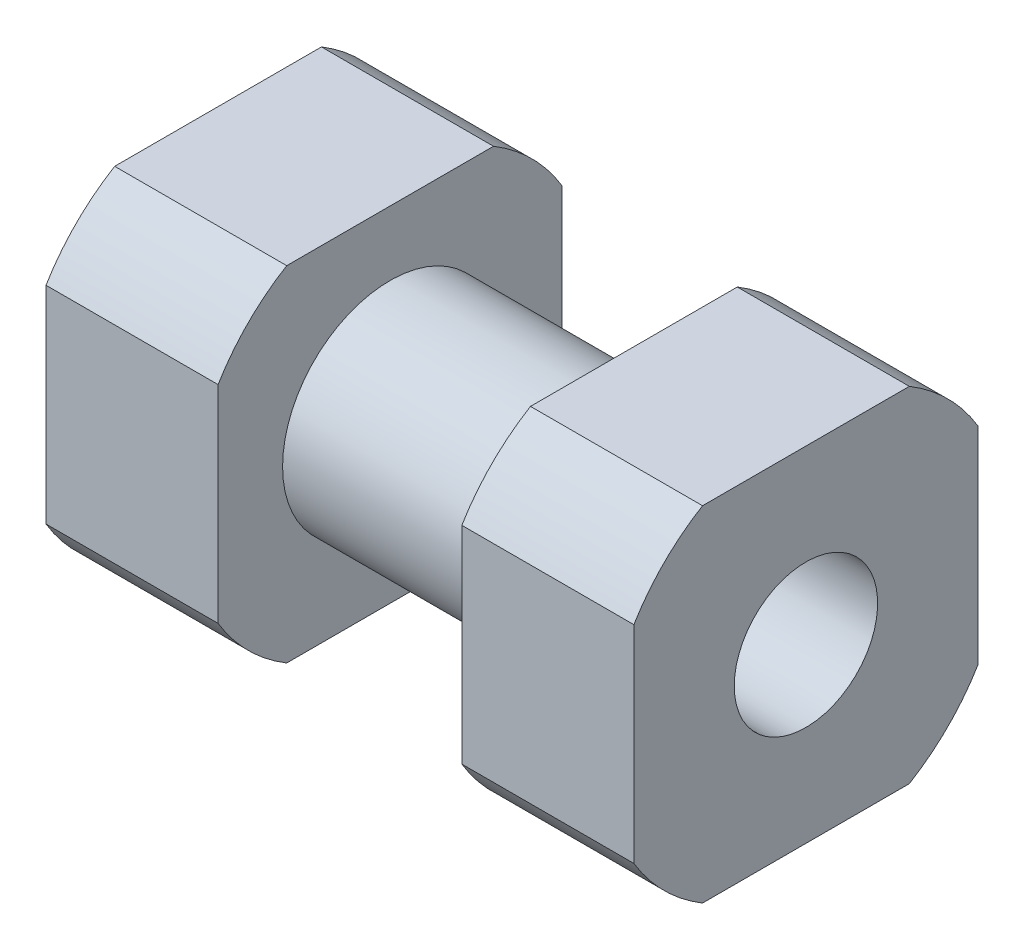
ISO-10303-21;
HEADER;
FILE_DESCRIPTION(('STEP AP214'),'2;1');
FILE_NAME('part.step','',(''),(''),'','','');
FILE_SCHEMA(('AUTOMOTIVE_DESIGN { 1 0 10303 214 1 1 1 1 }'));
ENDSEC;
DATA;
#1=APPLICATION_CONTEXT('core data for automotive mechanical design processes');
#2=APPLICATION_PROTOCOL_DEFINITION('international standard','automotive_design',2000,#1);
#3=PRODUCT_CONTEXT('',#1,'mechanical');
#4=PRODUCT('Part','Part','',(#3));
#5=PRODUCT_RELATED_PRODUCT_CATEGORY('part','',(#4));
#6=PRODUCT_DEFINITION_FORMATION('','',#4);
#7=PRODUCT_DEFINITION_CONTEXT('part definition',#1,'design');
#8=PRODUCT_DEFINITION('design','',#6,#7);
#9=PRODUCT_DEFINITION_SHAPE('','',#8);
#10=(LENGTH_UNIT() NAMED_UNIT(*) SI_UNIT(.MILLI.,.METRE.));
#11=(NAMED_UNIT(*) PLANE_ANGLE_UNIT() SI_UNIT($,.RADIAN.));
#12=(NAMED_UNIT(*) SI_UNIT($,.STERADIAN.) SOLID_ANGLE_UNIT());
#13=UNCERTAINTY_MEASURE_WITH_UNIT(LENGTH_MEASURE(1.E-05),#10,'distance_accuracy_value','');
#14=(GEOMETRIC_REPRESENTATION_CONTEXT(3) GLOBAL_UNCERTAINTY_ASSIGNED_CONTEXT((#13)) GLOBAL_UNIT_ASSIGNED_CONTEXT((#10,
#11,#12)) REPRESENTATION_CONTEXT('',''));
#15=CARTESIAN_POINT('',(0.,0.,0.));
#16=DIRECTION('',(0.,0.,1.));
#17=DIRECTION('',(1.,0.,0.));
#18=AXIS2_PLACEMENT_3D('',#15,#16,#17);
#19=CARTESIAN_POINT('',(-231.615252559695,14.,0.));
#20=DIRECTION('',(1.,0.,0.));
#21=DIRECTION('',(0.,0.,-1.));
#22=AXIS2_PLACEMENT_3D('',#19,#20,#21);
#23=PLANE('',#22);
#24=CARTESIAN_POINT('',(-231.615252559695,14.,0.));
#25=DIRECTION('',(-1.,0.,0.));
#26=DIRECTION('',(0.,0.,1.));
#27=AXIS2_PLACEMENT_3D('',#24,#25,#26);
#28=CIRCLE('',#27,2.5);
#29=CARTESIAN_POINT('',(-231.615252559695,14.,2.5));
#30=VERTEX_POINT('',#29);
#31=EDGE_CURVE('E194',#30,#30,#28,.T.);
#32=ORIENTED_EDGE('',*,*,#31,.F.);
#33=EDGE_LOOP('',(#32));
#34=FACE_BOUND('',#33,.T.);
#35=DIRECTION('',(0.,1.,0.));
#36=VECTOR('',#35,1.);
#37=CARTESIAN_POINT('',(-231.615252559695,8.,6.));
#38=LINE('',#37,#36);
#39=CARTESIAN_POINT('',(-231.615252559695,10.394448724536,6.));
#40=VERTEX_POINT('',#39);
#41=CARTESIAN_POINT('',(-231.615252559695,17.605551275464,6.));
#42=VERTEX_POINT('',#41);
#43=EDGE_CURVE('E138',#40,#42,#38,.T.);
#44=ORIENTED_EDGE('',*,*,#43,.T.);
#45=CARTESIAN_POINT('',(-231.615252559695,14.,0.));
#46=DIRECTION('',(-1.,0.,0.));
#47=DIRECTION('',(0.,0.,1.));
#48=AXIS2_PLACEMENT_3D('',#45,#46,#47);
#49=CIRCLE('',#48,7.);
#50=CARTESIAN_POINT('',(-231.615252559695,20.,3.60555127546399));
#51=VERTEX_POINT('',#50);
#52=EDGE_CURVE('E145',#42,#51,#49,.T.);
#53=ORIENTED_EDGE('',*,*,#52,.T.);
#54=DIRECTION('',(0.,0.,-1.));
#55=VECTOR('',#54,1.);
#56=CARTESIAN_POINT('',(-231.615252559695,20.,-6.));
#57=LINE('',#56,#55);
#58=CARTESIAN_POINT('',(-231.615252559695,20.,-3.60555127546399));
#59=VERTEX_POINT('',#58);
#60=EDGE_CURVE('E126',#51,#59,#57,.T.);
#61=ORIENTED_EDGE('',*,*,#60,.T.);
#62=CARTESIAN_POINT('',(-231.615252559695,17.605551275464,-6.));
#63=VERTEX_POINT('',#62);
#64=EDGE_CURVE('E153',#59,#63,#49,.T.);
#65=ORIENTED_EDGE('',*,*,#64,.T.);
#66=DIRECTION('',(0.,-1.,0.));
#67=VECTOR('',#66,1.);
#68=CARTESIAN_POINT('',(-231.615252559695,8.,-6.));
#69=LINE('',#68,#67);
#70=CARTESIAN_POINT('',(-231.615252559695,10.394448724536,-6.));
#71=VERTEX_POINT('',#70);
#72=EDGE_CURVE('E137',#63,#71,#69,.T.);
#73=ORIENTED_EDGE('',*,*,#72,.T.);
#74=CARTESIAN_POINT('',(-231.615252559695,8.,-3.60555127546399));
#75=VERTEX_POINT('',#74);
#76=EDGE_CURVE('E158',#71,#75,#49,.T.);
#77=ORIENTED_EDGE('',*,*,#76,.T.);
#78=DIRECTION('',(0.,0.,1.));
#79=VECTOR('',#78,1.);
#80=CARTESIAN_POINT('',(-231.615252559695,8.,-6.));
#81=LINE('',#80,#79);
#82=CARTESIAN_POINT('',(-231.615252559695,8.,3.60555127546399));
#83=VERTEX_POINT('',#82);
#84=EDGE_CURVE('E239',#75,#83,#81,.T.);
#85=ORIENTED_EDGE('',*,*,#84,.T.);
#86=EDGE_CURVE('E155',#83,#40,#49,.T.);
#87=ORIENTED_EDGE('',*,*,#86,.T.);
#88=EDGE_LOOP('',(#44,#53,#61,#65,#73,#77,#85,#87));
#89=FACE_BOUND('',#88,.T.);
#90=ADVANCED_FACE('F16',(#34,#89),#23,.F.);
#91=CARTESIAN_POINT('',(-235.530745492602,14.,0.));
#92=DIRECTION('',(-1.,0.,0.));
#93=DIRECTION('',(0.,0.,1.));
#94=AXIS2_PLACEMENT_3D('',#91,#92,#93);
#95=CYLINDRICAL_SURFACE('',#94,7.);
#96=DIRECTION('',(-1.,0.,0.));
#97=VECTOR('',#96,1.);
#98=CARTESIAN_POINT('',(-235.530745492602,17.605551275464,6.));
#99=LINE('',#98,#97);
#100=CARTESIAN_POINT('',(-225.615252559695,17.605551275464,6.));
#101=VERTEX_POINT('',#100);
#102=EDGE_CURVE('E197',#101,#42,#99,.T.);
#103=ORIENTED_EDGE('',*,*,#102,.F.);
#104=CARTESIAN_POINT('',(-225.615252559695,14.,0.));
#105=DIRECTION('',(-1.,0.,0.));
#106=DIRECTION('',(0.,0.,1.));
#107=AXIS2_PLACEMENT_3D('',#104,#105,#106);
#108=CIRCLE('',#107,7.);
#109=CARTESIAN_POINT('',(-225.615252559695,20.,3.60555127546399));
#110=VERTEX_POINT('',#109);
#111=EDGE_CURVE('E147',#101,#110,#108,.T.);
#112=ORIENTED_EDGE('',*,*,#111,.T.);
#113=DIRECTION('',(-1.,0.,0.));
#114=VECTOR('',#113,1.);
#115=CARTESIAN_POINT('',(-235.530745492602,20.,3.60555127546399));
#116=LINE('',#115,#114);
#117=EDGE_CURVE('E129',#51,#110,#116,.F.);
#118=ORIENTED_EDGE('',*,*,#117,.F.);
#119=ORIENTED_EDGE('',*,*,#52,.F.);
#120=EDGE_LOOP('',(#103,#112,#118,#119));
#121=FACE_BOUND('',#120,.T.);
#122=ADVANCED_FACE('F144',(#121),#95,.T.);
#123=DIRECTION('',(-1.,0.,0.));
#124=VECTOR('',#123,1.);
#125=CARTESIAN_POINT('',(-235.530745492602,10.394448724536,6.));
#126=LINE('',#125,#124);
#127=CARTESIAN_POINT('',(-225.615252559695,10.394448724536,6.));
#128=VERTEX_POINT('',#127);
#129=EDGE_CURVE('E30',#40,#128,#126,.F.);
#130=ORIENTED_EDGE('',*,*,#129,.F.);
#131=ORIENTED_EDGE('',*,*,#86,.F.);
#132=DIRECTION('',(-1.,0.,0.));
#133=VECTOR('',#132,1.);
#134=CARTESIAN_POINT('',(-235.530745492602,8.,3.60555127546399));
#135=LINE('',#134,#133);
#136=CARTESIAN_POINT('',(-225.615252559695,8.,3.60555127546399));
#137=VERTEX_POINT('',#136);
#138=EDGE_CURVE('E208',#137,#83,#135,.T.);
#139=ORIENTED_EDGE('',*,*,#138,.F.);
#140=EDGE_CURVE('E164',#137,#128,#108,.T.);
#141=ORIENTED_EDGE('',*,*,#140,.T.);
#142=EDGE_LOOP('',(#130,#131,#139,#141));
#143=FACE_BOUND('',#142,.T.);
#144=ADVANCED_FACE('F255',(#143),#95,.T.);
#145=DIRECTION('',(-1.,0.,0.));
#146=VECTOR('',#145,1.);
#147=CARTESIAN_POINT('',(-235.530745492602,8.,-3.60555127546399));
#148=LINE('',#147,#146);
#149=CARTESIAN_POINT('',(-225.615252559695,8.,-3.60555127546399));
#150=VERTEX_POINT('',#149);
#151=EDGE_CURVE('E38',#75,#150,#148,.F.);
#152=ORIENTED_EDGE('',*,*,#151,.F.);
#153=ORIENTED_EDGE('',*,*,#76,.F.);
#154=DIRECTION('',(-1.,0.,0.));
#155=VECTOR('',#154,1.);
#156=CARTESIAN_POINT('',(-235.530745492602,10.394448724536,-6.));
#157=LINE('',#156,#155);
#158=CARTESIAN_POINT('',(-225.615252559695,10.394448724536,-6.));
#159=VERTEX_POINT('',#158);
#160=EDGE_CURVE('E219',#159,#71,#157,.T.);
#161=ORIENTED_EDGE('',*,*,#160,.F.);
#162=EDGE_CURVE('E166',#159,#150,#108,.T.);
#163=ORIENTED_EDGE('',*,*,#162,.T.);
#164=EDGE_LOOP('',(#152,#153,#161,#163));
#165=FACE_BOUND('',#164,.T.);
#166=ADVANCED_FACE('F248',(#165),#95,.T.);
#167=DIRECTION('',(-1.,0.,0.));
#168=VECTOR('',#167,1.);
#169=CARTESIAN_POINT('',(-235.530745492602,17.605551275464,-6.));
#170=LINE('',#169,#168);
#171=CARTESIAN_POINT('',(-225.615252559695,17.605551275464,-6.));
#172=VERTEX_POINT('',#171);
#173=EDGE_CURVE('E221',#63,#172,#170,.F.);
#174=ORIENTED_EDGE('',*,*,#173,.F.);
#175=ORIENTED_EDGE('',*,*,#64,.F.);
#176=DIRECTION('',(-1.,0.,0.));
#177=VECTOR('',#176,1.);
#178=CARTESIAN_POINT('',(-235.530745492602,20.,-3.60555127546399));
#179=LINE('',#178,#177);
#180=CARTESIAN_POINT('',(-225.615252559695,20.,-3.60555127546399));
#181=VERTEX_POINT('',#180);
#182=EDGE_CURVE('E132',#181,#59,#179,.T.);
#183=ORIENTED_EDGE('',*,*,#182,.F.);
#184=EDGE_CURVE('E163',#181,#172,#108,.T.);
#185=ORIENTED_EDGE('',*,*,#184,.T.);
#186=EDGE_LOOP('',(#174,#175,#183,#185));
#187=FACE_BOUND('',#186,.T.);
#188=ADVANCED_FACE('F263',(#187),#95,.T.);
#189=CARTESIAN_POINT('',(-225.615252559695,21.,0.));
#190=DIRECTION('',(-1.,0.,0.));
#191=DIRECTION('',(0.,0.,1.));
#192=AXIS2_PLACEMENT_3D('',#189,#190,#191);
#193=PLANE('',#192);
#194=CARTESIAN_POINT('',(-225.615252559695,14.,0.));
#195=DIRECTION('',(-1.,0.,0.));
#196=DIRECTION('',(0.,0.,1.));
#197=AXIS2_PLACEMENT_3D('',#194,#195,#196);
#198=CIRCLE('',#197,3.75);
#199=CARTESIAN_POINT('',(-225.615252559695,14.,3.75));
#200=VERTEX_POINT('',#199);
#201=EDGE_CURVE('E169',#200,#200,#198,.T.);
#202=ORIENTED_EDGE('',*,*,#201,.T.);
#203=EDGE_LOOP('',(#202));
#204=FACE_BOUND('',#203,.T.);
#205=DIRECTION('',(0.,1.,0.));
#206=VECTOR('',#205,1.);
#207=CARTESIAN_POINT('',(-225.615252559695,21.,6.));
#208=LINE('',#207,#206);
#209=EDGE_CURVE('E200',#128,#101,#208,.T.);
#210=ORIENTED_EDGE('',*,*,#209,.F.);
#211=ORIENTED_EDGE('',*,*,#140,.F.);
#212=DIRECTION('',(0.,0.,1.));
#213=VECTOR('',#212,1.);
#214=CARTESIAN_POINT('',(-225.615252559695,8.,0.));
#215=LINE('',#214,#213);
#216=EDGE_CURVE('E211',#150,#137,#215,.T.);
#217=ORIENTED_EDGE('',*,*,#216,.F.);
#218=ORIENTED_EDGE('',*,*,#162,.F.);
#219=DIRECTION('',(0.,-1.,0.));
#220=VECTOR('',#219,1.);
#221=CARTESIAN_POINT('',(-225.615252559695,21.,-6.));
#222=LINE('',#221,#220);
#223=EDGE_CURVE('E223',#172,#159,#222,.T.);
#224=ORIENTED_EDGE('',*,*,#223,.F.);
#225=ORIENTED_EDGE('',*,*,#184,.F.);
#226=DIRECTION('',(0.,0.,-1.));
#227=VECTOR('',#226,1.);
#228=CARTESIAN_POINT('',(-225.615252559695,20.,0.));
#229=LINE('',#228,#227);
#230=EDGE_CURVE('E148',#110,#181,#229,.T.);
#231=ORIENTED_EDGE('',*,*,#230,.F.);
#232=ORIENTED_EDGE('',*,*,#111,.F.);
#233=EDGE_LOOP('',(#210,#211,#217,#218,#224,#225,#231,#232));
#234=FACE_BOUND('',#233,.T.);
#235=ADVANCED_FACE('F252',(#204,#234),#193,.F.);
#236=CARTESIAN_POINT('',(-217.115252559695,17.75,0.));
#237=DIRECTION('',(1.,0.,0.));
#238=DIRECTION('',(0.,0.,-1.));
#239=AXIS2_PLACEMENT_3D('',#236,#237,#238);
#240=PLANE('',#239);
#241=CARTESIAN_POINT('',(-217.115252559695,14.,0.));
#242=DIRECTION('',(-1.,0.,0.));
#243=DIRECTION('',(0.,0.,1.));
#244=AXIS2_PLACEMENT_3D('',#241,#242,#243);
#245=CIRCLE('',#244,3.75);
#246=CARTESIAN_POINT('',(-217.115252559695,14.,3.75));
#247=VERTEX_POINT('',#246);
#248=EDGE_CURVE('E175',#247,#247,#245,.T.);
#249=ORIENTED_EDGE('',*,*,#248,.F.);
#250=EDGE_LOOP('',(#249));
#251=FACE_BOUND('',#250,.T.);
#252=DIRECTION('',(0.,-1.,0.));
#253=VECTOR('',#252,1.);
#254=CARTESIAN_POINT('',(-217.115252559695,17.75,6.));
#255=LINE('',#254,#253);
#256=CARTESIAN_POINT('',(-217.115252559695,17.605551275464,6.));
#257=VERTEX_POINT('',#256);
#258=CARTESIAN_POINT('',(-217.115252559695,10.394448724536,6.));
#259=VERTEX_POINT('',#258);
#260=EDGE_CURVE('E204',#257,#259,#255,.T.);
#261=ORIENTED_EDGE('',*,*,#260,.F.);
#262=CARTESIAN_POINT('',(-217.115252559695,14.,0.));
#263=DIRECTION('',(-1.,0.,0.));
#264=DIRECTION('',(0.,0.,1.));
#265=AXIS2_PLACEMENT_3D('',#262,#263,#264);
#266=CIRCLE('',#265,7.);
#267=CARTESIAN_POINT('',(-217.115252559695,20.,3.60555127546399));
#268=VERTEX_POINT('',#267);
#269=EDGE_CURVE('E179',#257,#268,#266,.T.);
#270=ORIENTED_EDGE('',*,*,#269,.T.);
#271=DIRECTION('',(0.,0.,1.));
#272=VECTOR('',#271,1.);
#273=CARTESIAN_POINT('',(-217.115252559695,20.,0.));
#274=LINE('',#273,#272);
#275=CARTESIAN_POINT('',(-217.115252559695,20.,-3.60555127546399));
#276=VERTEX_POINT('',#275);
#277=EDGE_CURVE('E235',#276,#268,#274,.T.);
#278=ORIENTED_EDGE('',*,*,#277,.F.);
#279=CARTESIAN_POINT('',(-217.115252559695,17.605551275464,-6.));
#280=VERTEX_POINT('',#279);
#281=EDGE_CURVE('E184',#276,#280,#266,.T.);
#282=ORIENTED_EDGE('',*,*,#281,.T.);
#283=DIRECTION('',(0.,1.,0.));
#284=VECTOR('',#283,1.);
#285=CARTESIAN_POINT('',(-217.115252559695,17.75,-6.));
#286=LINE('',#285,#284);
#287=CARTESIAN_POINT('',(-217.115252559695,10.394448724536,-6.));
#288=VERTEX_POINT('',#287);
#289=EDGE_CURVE('E227',#288,#280,#286,.T.);
#290=ORIENTED_EDGE('',*,*,#289,.F.);
#291=CARTESIAN_POINT('',(-217.115252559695,8.,-3.60555127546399));
#292=VERTEX_POINT('',#291);
#293=EDGE_CURVE('E345',#288,#292,#266,.T.);
#294=ORIENTED_EDGE('',*,*,#293,.T.);
#295=DIRECTION('',(0.,0.,-1.));
#296=VECTOR('',#295,1.);
#297=CARTESIAN_POINT('',(-217.115252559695,8.,0.));
#298=LINE('',#297,#296);
#299=CARTESIAN_POINT('',(-217.115252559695,8.,3.60555127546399));
#300=VERTEX_POINT('',#299);
#301=EDGE_CURVE('E215',#300,#292,#298,.T.);
#302=ORIENTED_EDGE('',*,*,#301,.F.);
#303=EDGE_CURVE('E185',#300,#259,#266,.T.);
#304=ORIENTED_EDGE('',*,*,#303,.T.);
#305=EDGE_LOOP('',(#261,#270,#278,#282,#290,#294,#302,#304));
#306=FACE_BOUND('',#305,.T.);
#307=ADVANCED_FACE('F301',(#251,#306),#240,.F.);
#308=CARTESIAN_POINT('',(-235.530745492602,14.,0.));
#309=DIRECTION('',(-1.,0.,0.));
#310=DIRECTION('',(0.,0.,1.));
#311=AXIS2_PLACEMENT_3D('',#308,#309,#310);
#312=CYLINDRICAL_SURFACE('',#311,7.);
#313=DIRECTION('',(-1.,0.,0.));
#314=VECTOR('',#313,1.);
#315=CARTESIAN_POINT('',(-235.530745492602,17.605551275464,6.));
#316=LINE('',#315,#314);
#317=CARTESIAN_POINT('',(-211.115252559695,17.605551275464,6.));
#318=VERTEX_POINT('',#317);
#319=EDGE_CURVE('E202',#318,#257,#316,.T.);
#320=ORIENTED_EDGE('',*,*,#319,.F.);
#321=CARTESIAN_POINT('',(-211.115252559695,14.,0.));
#322=DIRECTION('',(-1.,0.,0.));
#323=DIRECTION('',(0.,0.,1.));
#324=AXIS2_PLACEMENT_3D('',#321,#322,#323);
#325=CIRCLE('',#324,7.);
#326=CARTESIAN_POINT('',(-211.115252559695,20.,3.60555127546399));
#327=VERTEX_POINT('',#326);
#328=EDGE_CURVE('E186',#318,#327,#325,.T.);
#329=ORIENTED_EDGE('',*,*,#328,.T.);
#330=DIRECTION('',(-1.,0.,0.));
#331=VECTOR('',#330,1.);
#332=CARTESIAN_POINT('',(-235.530745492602,20.,3.60555127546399));
#333=LINE('',#332,#331);
#334=EDGE_CURVE('E237',#268,#327,#333,.F.);
#335=ORIENTED_EDGE('',*,*,#334,.F.);
#336=ORIENTED_EDGE('',*,*,#269,.F.);
#337=EDGE_LOOP('',(#320,#329,#335,#336));
#338=FACE_BOUND('',#337,.T.);
#339=ADVANCED_FACE('F297',(#338),#312,.T.);
#340=DIRECTION('',(-1.,0.,0.));
#341=VECTOR('',#340,1.);
#342=CARTESIAN_POINT('',(-235.530745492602,10.394448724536,6.));
#343=LINE('',#342,#341);
#344=CARTESIAN_POINT('',(-211.115252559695,10.394448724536,6.));
#345=VERTEX_POINT('',#344);
#346=EDGE_CURVE('E206',#259,#345,#343,.F.);
#347=ORIENTED_EDGE('',*,*,#346,.F.);
#348=ORIENTED_EDGE('',*,*,#303,.F.);
#349=DIRECTION('',(-1.,0.,0.));
#350=VECTOR('',#349,1.);
#351=CARTESIAN_POINT('',(-235.530745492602,8.,3.60555127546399));
#352=LINE('',#351,#350);
#353=CARTESIAN_POINT('',(-211.115252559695,8.,3.60555127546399));
#354=VERTEX_POINT('',#353);
#355=EDGE_CURVE('E213',#354,#300,#352,.T.);
#356=ORIENTED_EDGE('',*,*,#355,.F.);
#357=EDGE_CURVE('E190',#354,#345,#325,.T.);
#358=ORIENTED_EDGE('',*,*,#357,.T.);
#359=EDGE_LOOP('',(#347,#348,#356,#358));
#360=FACE_BOUND('',#359,.T.);
#361=ADVANCED_FACE('F300',(#360),#312,.T.);
#362=DIRECTION('',(-1.,0.,0.));
#363=VECTOR('',#362,1.);
#364=CARTESIAN_POINT('',(-235.530745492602,8.,-3.60555127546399));
#365=LINE('',#364,#363);
#366=CARTESIAN_POINT('',(-211.115252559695,8.,-3.60555127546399));
#367=VERTEX_POINT('',#366);
#368=EDGE_CURVE('E217',#292,#367,#365,.F.);
#369=ORIENTED_EDGE('',*,*,#368,.F.);
#370=ORIENTED_EDGE('',*,*,#293,.F.);
#371=DIRECTION('',(-1.,0.,0.));
#372=VECTOR('',#371,1.);
#373=CARTESIAN_POINT('',(-235.530745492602,10.394448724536,-6.));
#374=LINE('',#373,#372);
#375=CARTESIAN_POINT('',(-211.115252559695,10.394448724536,-6.));
#376=VERTEX_POINT('',#375);
#377=EDGE_CURVE('E225',#376,#288,#374,.T.);
#378=ORIENTED_EDGE('',*,*,#377,.F.);
#379=EDGE_CURVE('E370',#376,#367,#325,.T.);
#380=ORIENTED_EDGE('',*,*,#379,.T.);
#381=EDGE_LOOP('',(#369,#370,#378,#380));
#382=FACE_BOUND('',#381,.T.);
#383=ADVANCED_FACE('F349',(#382),#312,.T.);
#384=DIRECTION('',(-1.,0.,0.));
#385=VECTOR('',#384,1.);
#386=CARTESIAN_POINT('',(-235.530745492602,17.605551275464,-6.));
#387=LINE('',#386,#385);
#388=CARTESIAN_POINT('',(-211.115252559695,17.605551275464,-6.));
#389=VERTEX_POINT('',#388);
#390=EDGE_CURVE('E229',#280,#389,#387,.F.);
#391=ORIENTED_EDGE('',*,*,#390,.F.);
#392=ORIENTED_EDGE('',*,*,#281,.F.);
#393=DIRECTION('',(-1.,0.,0.));
#394=VECTOR('',#393,1.);
#395=CARTESIAN_POINT('',(-235.530745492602,20.,-3.60555127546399));
#396=LINE('',#395,#394);
#397=CARTESIAN_POINT('',(-211.115252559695,20.,-3.60555127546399));
#398=VERTEX_POINT('',#397);
#399=EDGE_CURVE('E233',#398,#276,#396,.T.);
#400=ORIENTED_EDGE('',*,*,#399,.F.);
#401=EDGE_CURVE('E189',#398,#389,#325,.T.);
#402=ORIENTED_EDGE('',*,*,#401,.T.);
#403=EDGE_LOOP('',(#391,#392,#400,#402));
#404=FACE_BOUND('',#403,.T.);
#405=ADVANCED_FACE('F295',(#404),#312,.T.);
#406=CARTESIAN_POINT('',(-211.115252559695,21.,0.));
#407=DIRECTION('',(-1.,0.,0.));
#408=DIRECTION('',(0.,0.,1.));
#409=AXIS2_PLACEMENT_3D('',#406,#407,#408);
#410=PLANE('',#409);
#411=CARTESIAN_POINT('',(-211.115252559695,14.,0.));
#412=DIRECTION('',(-1.,0.,0.));
#413=DIRECTION('',(0.,0.,1.));
#414=AXIS2_PLACEMENT_3D('',#411,#412,#413);
#415=CIRCLE('',#414,2.5);
#416=CARTESIAN_POINT('',(-211.115252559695,14.,2.5));
#417=VERTEX_POINT('',#416);
#418=EDGE_CURVE('E191',#417,#417,#415,.T.);
#419=ORIENTED_EDGE('',*,*,#418,.T.);
#420=EDGE_LOOP('',(#419));
#421=FACE_BOUND('',#420,.T.);
#422=DIRECTION('',(0.,1.,0.));
#423=VECTOR('',#422,1.);
#424=CARTESIAN_POINT('',(-211.115252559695,21.,6.));
#425=LINE('',#424,#423);
#426=EDGE_CURVE('E11',#345,#318,#425,.T.);
#427=ORIENTED_EDGE('',*,*,#426,.F.);
#428=ORIENTED_EDGE('',*,*,#357,.F.);
#429=DIRECTION('',(0.,0.,1.));
#430=VECTOR('',#429,1.);
#431=CARTESIAN_POINT('',(-211.115252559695,8.,0.));
#432=LINE('',#431,#430);
#433=EDGE_CURVE('E23',#367,#354,#432,.T.);
#434=ORIENTED_EDGE('',*,*,#433,.F.);
#435=ORIENTED_EDGE('',*,*,#379,.F.);
#436=DIRECTION('',(0.,-1.,0.));
#437=VECTOR('',#436,1.);
#438=CARTESIAN_POINT('',(-211.115252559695,21.,-6.));
#439=LINE('',#438,#437);
#440=EDGE_CURVE('E156',#389,#376,#439,.T.);
#441=ORIENTED_EDGE('',*,*,#440,.F.);
#442=ORIENTED_EDGE('',*,*,#401,.F.);
#443=DIRECTION('',(0.,0.,-1.));
#444=VECTOR('',#443,1.);
#445=CARTESIAN_POINT('',(-211.115252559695,20.,0.));
#446=LINE('',#445,#444);
#447=EDGE_CURVE('E152',#327,#398,#446,.T.);
#448=ORIENTED_EDGE('',*,*,#447,.F.);
#449=ORIENTED_EDGE('',*,*,#328,.F.);
#450=EDGE_LOOP('',(#427,#428,#434,#435,#441,#442,#448,#449));
#451=FACE_BOUND('',#450,.T.);
#452=ADVANCED_FACE('F286',(#421,#451),#410,.F.);
#453=CARTESIAN_POINT('',(-235.530745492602,14.,0.));
#454=DIRECTION('',(-1.,0.,0.));
#455=DIRECTION('',(0.,0.,1.));
#456=AXIS2_PLACEMENT_3D('',#453,#454,#455);
#457=CYLINDRICAL_SURFACE('',#456,3.75);
#458=ORIENTED_EDGE('',*,*,#201,.F.);
#459=EDGE_LOOP('',(#458));
#460=FACE_BOUND('',#459,.T.);
#461=ORIENTED_EDGE('',*,*,#248,.T.);
#462=EDGE_LOOP('',(#461));
#463=FACE_BOUND('',#462,.T.);
#464=ADVANCED_FACE('F275',(#460,#463),#457,.T.);
#465=CARTESIAN_POINT('',(-231.615252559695,14.,0.));
#466=DIRECTION('',(-1.,0.,0.));
#467=DIRECTION('',(0.,0.,1.));
#468=AXIS2_PLACEMENT_3D('',#465,#466,#467);
#469=CYLINDRICAL_SURFACE('',#468,2.5);
#470=ORIENTED_EDGE('',*,*,#418,.F.);
#471=EDGE_LOOP('',(#470));
#472=FACE_BOUND('',#471,.T.);
#473=ORIENTED_EDGE('',*,*,#31,.T.);
#474=EDGE_LOOP('',(#473));
#475=FACE_BOUND('',#474,.T.);
#476=ADVANCED_FACE('F272',(#472,#475),#469,.F.);
#477=CARTESIAN_POINT('',(-211.115252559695,20.,-6.));
#478=DIRECTION('',(0.,1.,0.));
#479=DIRECTION('',(0.,0.,1.));
#480=AXIS2_PLACEMENT_3D('',#477,#478,#479);
#481=PLANE('',#480);
#482=ORIENTED_EDGE('',*,*,#399,.T.);
#483=ORIENTED_EDGE('',*,*,#277,.T.);
#484=ORIENTED_EDGE('',*,*,#334,.T.);
#485=ORIENTED_EDGE('',*,*,#447,.T.);
#486=EDGE_LOOP('',(#482,#483,#484,#485));
#487=FACE_BOUND('',#486,.T.);
#488=ADVANCED_FACE('F274',(#487),#481,.T.);
#489=CARTESIAN_POINT('',(-211.115252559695,8.,-6.));
#490=DIRECTION('',(0.,0.,-1.));
#491=DIRECTION('',(-1.,0.,0.));
#492=AXIS2_PLACEMENT_3D('',#489,#490,#491);
#493=PLANE('',#492);
#494=ORIENTED_EDGE('',*,*,#377,.T.);
#495=ORIENTED_EDGE('',*,*,#289,.T.);
#496=ORIENTED_EDGE('',*,*,#390,.T.);
#497=ORIENTED_EDGE('',*,*,#440,.T.);
#498=EDGE_LOOP('',(#494,#495,#496,#497));
#499=FACE_BOUND('',#498,.T.);
#500=ADVANCED_FACE('F283',(#499),#493,.T.);
#501=CARTESIAN_POINT('',(-211.115252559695,8.,-6.));
#502=DIRECTION('',(0.,-1.,0.));
#503=DIRECTION('',(0.,0.,-1.));
#504=AXIS2_PLACEMENT_3D('',#501,#502,#503);
#505=PLANE('',#504);
#506=ORIENTED_EDGE('',*,*,#355,.T.);
#507=ORIENTED_EDGE('',*,*,#301,.T.);
#508=ORIENTED_EDGE('',*,*,#368,.T.);
#509=ORIENTED_EDGE('',*,*,#433,.T.);
#510=EDGE_LOOP('',(#506,#507,#508,#509));
#511=FACE_BOUND('',#510,.T.);
#512=ADVANCED_FACE('F323',(#511),#505,.T.);
#513=CARTESIAN_POINT('',(-211.115252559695,8.,6.));
#514=DIRECTION('',(0.,0.,1.));
#515=DIRECTION('',(1.,0.,0.));
#516=AXIS2_PLACEMENT_3D('',#513,#514,#515);
#517=PLANE('',#516);
#518=ORIENTED_EDGE('',*,*,#319,.T.);
#519=ORIENTED_EDGE('',*,*,#260,.T.);
#520=ORIENTED_EDGE('',*,*,#346,.T.);
#521=ORIENTED_EDGE('',*,*,#426,.T.);
#522=EDGE_LOOP('',(#518,#519,#520,#521));
#523=FACE_BOUND('',#522,.T.);
#524=ADVANCED_FACE('F324',(#523),#517,.T.);
#525=ORIENTED_EDGE('',*,*,#182,.T.);
#526=ORIENTED_EDGE('',*,*,#60,.F.);
#527=ORIENTED_EDGE('',*,*,#117,.T.);
#528=ORIENTED_EDGE('',*,*,#230,.T.);
#529=EDGE_LOOP('',(#525,#526,#527,#528));
#530=FACE_BOUND('',#529,.T.);
#531=ADVANCED_FACE('F128',(#530),#481,.T.);
#532=ORIENTED_EDGE('',*,*,#160,.T.);
#533=ORIENTED_EDGE('',*,*,#72,.F.);
#534=ORIENTED_EDGE('',*,*,#173,.T.);
#535=ORIENTED_EDGE('',*,*,#223,.T.);
#536=EDGE_LOOP('',(#532,#533,#534,#535));
#537=FACE_BOUND('',#536,.T.);
#538=ADVANCED_FACE('F314',(#537),#493,.T.);
#539=ORIENTED_EDGE('',*,*,#138,.T.);
#540=ORIENTED_EDGE('',*,*,#84,.F.);
#541=ORIENTED_EDGE('',*,*,#151,.T.);
#542=ORIENTED_EDGE('',*,*,#216,.T.);
#543=EDGE_LOOP('',(#539,#540,#541,#542));
#544=FACE_BOUND('',#543,.T.);
#545=ADVANCED_FACE('F254',(#544),#505,.T.);
#546=ORIENTED_EDGE('',*,*,#102,.T.);
#547=ORIENTED_EDGE('',*,*,#43,.F.);
#548=ORIENTED_EDGE('',*,*,#129,.T.);
#549=ORIENTED_EDGE('',*,*,#209,.T.);
#550=EDGE_LOOP('',(#546,#547,#548,#549));
#551=FACE_BOUND('',#550,.T.);
#552=ADVANCED_FACE('F292',(#551),#517,.T.);
#553=CLOSED_SHELL('',(#90,#122,#144,#166,#188,#235,#307,#339,#361,#383,#405,#452,#464,#476,#488,
#500,#512,#524,#531,#538,#545,#552));
#554=MANIFOLD_SOLID_BREP('B1',#553);
#555=ADVANCED_BREP_SHAPE_REPRESENTATION('',(#18,#554),#14);
#556=SHAPE_DEFINITION_REPRESENTATION(#9,#555);
ENDSEC;
END-ISO-10303-21;
